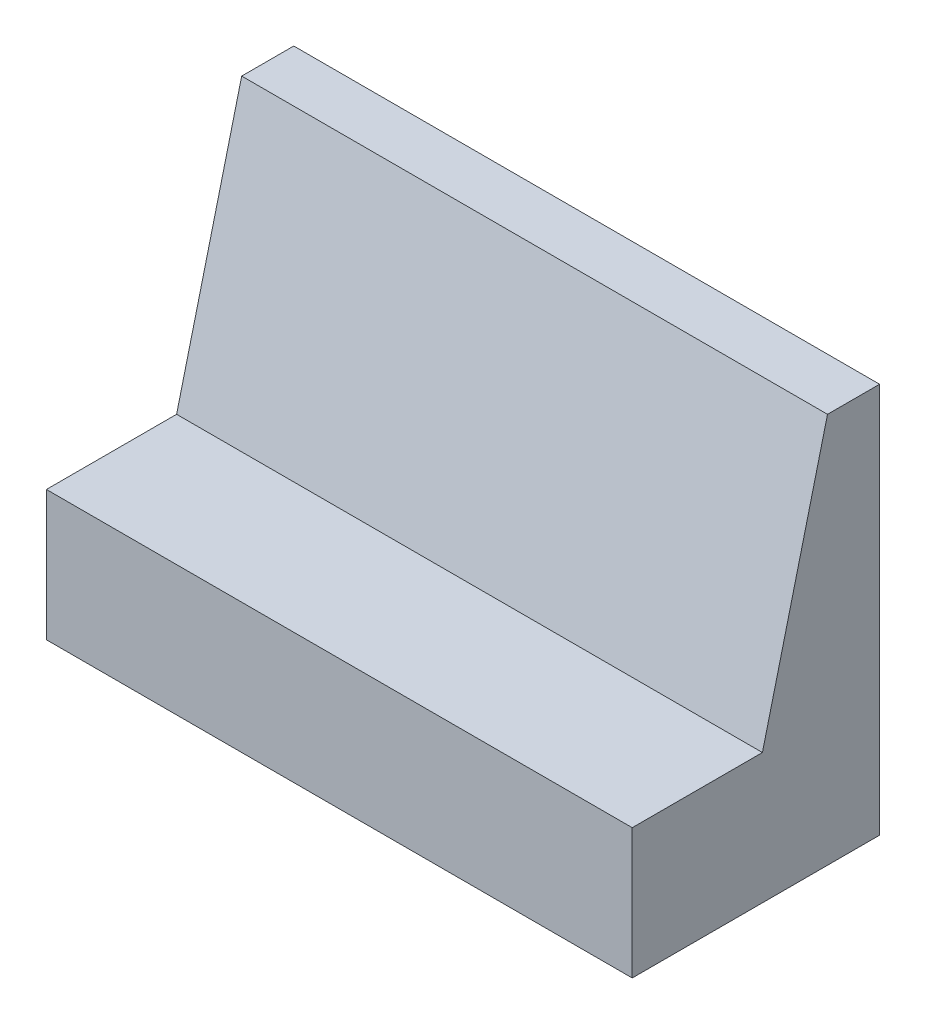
from build123d import *

# Parameters (mm, degrees)
BOSS_EXTRUDE1_DEPTH = 45
SKETCH2_R           = 4
CUT_EXTRUDE1_DEPTH  = 5


with BuildPart() as part:
    # Sketch1 → Boss-Extrude1 (new body)
    with BuildSketch(Plane(origin=(0, 0, 0), x_dir=(0, 0, -1), z_dir=(1, 0, 0))):
        Polygon((15, 30), (10, 10), (0, 10), (0, 0), (19, 0), (19, 10), (19, 30), align=None)
    extrude(amount=-BOSS_EXTRUDE1_DEPTH)

    # Sketch2 → Cut-Extrude1 (cut)
    with BuildSketch(Plane.XZ):
        with Locations(Location((-33.75, -10, 0), (0, 0, 270))):
            Circle(SKETCH2_R)
        with Locations(Location((-11.25, -10, 0), (0, 0, 270))):
            Circle(SKETCH2_R)
    extrude(amount=-CUT_EXTRUDE1_DEPTH, mode=Mode.SUBTRACT)


solid = part.part
